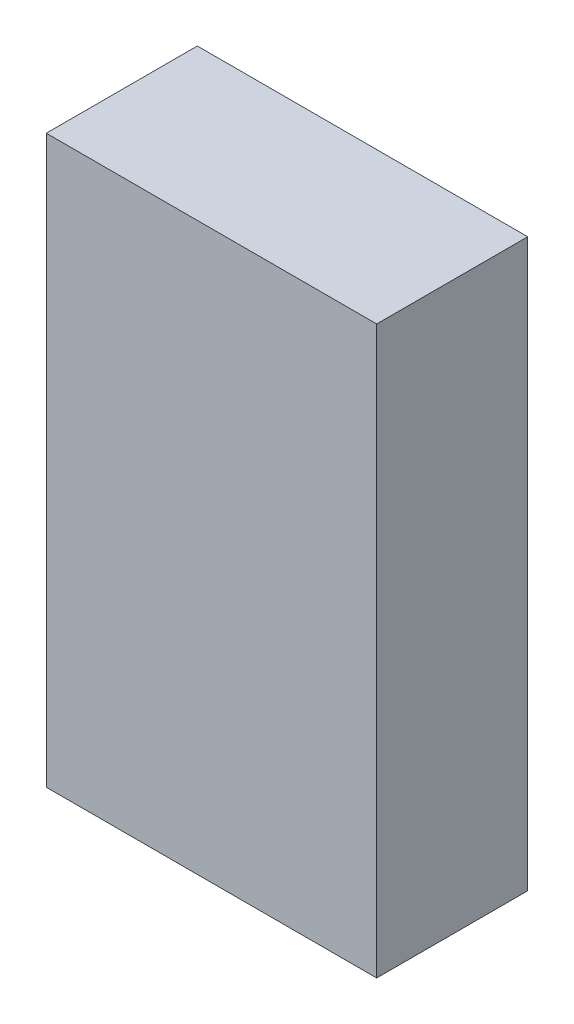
ISO-10303-21;
HEADER;
FILE_DESCRIPTION(('STEP AP214'),'2;1');
FILE_NAME('part.step','',(''),(''),'','','');
FILE_SCHEMA(('AUTOMOTIVE_DESIGN { 1 0 10303 214 1 1 1 1 }'));
ENDSEC;
DATA;
#1=APPLICATION_CONTEXT('core data for automotive mechanical design processes');
#2=APPLICATION_PROTOCOL_DEFINITION('international standard','automotive_design',2000,#1);
#3=PRODUCT_CONTEXT('',#1,'mechanical');
#4=PRODUCT('Part','Part','',(#3));
#5=PRODUCT_RELATED_PRODUCT_CATEGORY('part','',(#4));
#6=PRODUCT_DEFINITION_FORMATION('','',#4);
#7=PRODUCT_DEFINITION_CONTEXT('part definition',#1,'design');
#8=PRODUCT_DEFINITION('design','',#6,#7);
#9=PRODUCT_DEFINITION_SHAPE('','',#8);
#10=(LENGTH_UNIT() NAMED_UNIT(*) SI_UNIT(.MILLI.,.METRE.));
#11=(NAMED_UNIT(*) PLANE_ANGLE_UNIT() SI_UNIT($,.RADIAN.));
#12=(NAMED_UNIT(*) SI_UNIT($,.STERADIAN.) SOLID_ANGLE_UNIT());
#13=UNCERTAINTY_MEASURE_WITH_UNIT(LENGTH_MEASURE(1.E-05),#10,'distance_accuracy_value','');
#14=(GEOMETRIC_REPRESENTATION_CONTEXT(3) GLOBAL_UNCERTAINTY_ASSIGNED_CONTEXT((#13)) GLOBAL_UNIT_ASSIGNED_CONTEXT((#10,
#11,#12)) REPRESENTATION_CONTEXT('',''));
#15=CARTESIAN_POINT('',(0.,0.,0.));
#16=DIRECTION('',(0.,0.,1.));
#17=DIRECTION('',(1.,0.,0.));
#18=AXIS2_PLACEMENT_3D('',#15,#16,#17);
#19=CARTESIAN_POINT('',(0.87500206,1.49999954,0.8));
#20=DIRECTION('',(0.,0.,1.));
#21=DIRECTION('',(1.,0.,0.));
#22=AXIS2_PLACEMENT_3D('',#19,#20,#21);
#23=PLANE('',#22);
#24=DIRECTION('',(1.,0.,0.));
#25=VECTOR('',#24,1.);
#26=CARTESIAN_POINT('',(0.87500206,-1.49999954,0.8));
#27=LINE('',#26,#25);
#28=CARTESIAN_POINT('',(0.87500206,-1.49999954,0.8));
#29=VERTEX_POINT('',#28);
#30=CARTESIAN_POINT('',(-0.87499952,-1.49999954,0.8));
#31=VERTEX_POINT('',#30);
#32=EDGE_CURVE('E53',#29,#31,#27,.F.);
#33=ORIENTED_EDGE('',*,*,#32,.F.);
#34=DIRECTION('',(0.,1.,0.));
#35=VECTOR('',#34,1.);
#36=CARTESIAN_POINT('',(0.87500206,1.49999954,0.8));
#37=LINE('',#36,#35);
#38=CARTESIAN_POINT('',(0.87500206,1.49999954,0.8));
#39=VERTEX_POINT('',#38);
#40=EDGE_CURVE('E68',#39,#29,#37,.F.);
#41=ORIENTED_EDGE('',*,*,#40,.F.);
#42=DIRECTION('',(1.,0.,0.));
#43=VECTOR('',#42,1.);
#44=CARTESIAN_POINT('',(-0.87499952,1.49999954,0.8));
#45=LINE('',#44,#43);
#46=CARTESIAN_POINT('',(-0.87499952,1.49999954,0.8));
#47=VERTEX_POINT('',#46);
#48=EDGE_CURVE('E20',#47,#39,#45,.T.);
#49=ORIENTED_EDGE('',*,*,#48,.F.);
#50=DIRECTION('',(0.,1.,0.));
#51=VECTOR('',#50,1.);
#52=CARTESIAN_POINT('',(-0.87499952,-1.49999954,0.8));
#53=LINE('',#52,#51);
#54=EDGE_CURVE('E58',#31,#47,#53,.T.);
#55=ORIENTED_EDGE('',*,*,#54,.F.);
#56=EDGE_LOOP('',(#33,#41,#49,#55));
#57=FACE_BOUND('',#56,.T.);
#58=ADVANCED_FACE('F17',(#57),#23,.T.);
#59=CARTESIAN_POINT('',(-0.87499952,1.49999954,0.));
#60=DIRECTION('',(0.,1.,0.));
#61=DIRECTION('',(0.,0.,1.));
#62=AXIS2_PLACEMENT_3D('',#59,#60,#61);
#63=PLANE('',#62);
#64=DIRECTION('',(0.,0.,-1.));
#65=VECTOR('',#64,1.);
#66=CARTESIAN_POINT('',(0.87500206,1.49999954,0.));
#67=LINE('',#66,#65);
#68=CARTESIAN_POINT('',(0.87500206,1.49999954,0.));
#69=VERTEX_POINT('',#68);
#70=EDGE_CURVE('E79',#69,#39,#67,.F.);
#71=ORIENTED_EDGE('',*,*,#70,.F.);
#72=DIRECTION('',(1.,0.,0.));
#73=VECTOR('',#72,1.);
#74=CARTESIAN_POINT('',(0.87500206,1.49999954,0.));
#75=LINE('',#74,#73);
#76=CARTESIAN_POINT('',(-0.87499952,1.49999954,0.));
#77=VERTEX_POINT('',#76);
#78=EDGE_CURVE('E74',#69,#77,#75,.F.);
#79=ORIENTED_EDGE('',*,*,#78,.T.);
#80=DIRECTION('',(0.,0.,1.));
#81=VECTOR('',#80,1.);
#82=CARTESIAN_POINT('',(-0.87499952,1.49999954,0.));
#83=LINE('',#82,#81);
#84=EDGE_CURVE('E63',#47,#77,#83,.F.);
#85=ORIENTED_EDGE('',*,*,#84,.F.);
#86=ORIENTED_EDGE('',*,*,#48,.T.);
#87=EDGE_LOOP('',(#71,#79,#85,#86));
#88=FACE_BOUND('',#87,.T.);
#89=ADVANCED_FACE('F73',(#88),#63,.T.);
#90=CARTESIAN_POINT('',(-0.87499952,-1.49999954,0.));
#91=DIRECTION('',(-1.,0.,0.));
#92=DIRECTION('',(0.,0.,1.));
#93=AXIS2_PLACEMENT_3D('',#90,#91,#92);
#94=PLANE('',#93);
#95=ORIENTED_EDGE('',*,*,#84,.T.);
#96=DIRECTION('',(0.,1.,0.));
#97=VECTOR('',#96,1.);
#98=CARTESIAN_POINT('',(-0.87499952,1.49999954,0.));
#99=LINE('',#98,#97);
#100=CARTESIAN_POINT('',(-0.87499952,-1.49999954,0.));
#101=VERTEX_POINT('',#100);
#102=EDGE_CURVE('E84',#77,#101,#99,.F.);
#103=ORIENTED_EDGE('',*,*,#102,.T.);
#104=DIRECTION('',(0.,0.,-1.));
#105=VECTOR('',#104,1.);
#106=CARTESIAN_POINT('',(-0.87499952,-1.49999954,0.));
#107=LINE('',#106,#105);
#108=EDGE_CURVE('E65',#31,#101,#107,.T.);
#109=ORIENTED_EDGE('',*,*,#108,.F.);
#110=ORIENTED_EDGE('',*,*,#54,.T.);
#111=EDGE_LOOP('',(#95,#103,#109,#110));
#112=FACE_BOUND('',#111,.T.);
#113=ADVANCED_FACE('F60',(#112),#94,.T.);
#114=CARTESIAN_POINT('',(0.87500206,-1.49999954,0.));
#115=DIRECTION('',(0.,-1.,0.));
#116=DIRECTION('',(0.,0.,-1.));
#117=AXIS2_PLACEMENT_3D('',#114,#115,#116);
#118=PLANE('',#117);
#119=ORIENTED_EDGE('',*,*,#108,.T.);
#120=DIRECTION('',(1.,0.,0.));
#121=VECTOR('',#120,1.);
#122=CARTESIAN_POINT('',(0.87500206,-1.49999954,0.));
#123=LINE('',#122,#121);
#124=CARTESIAN_POINT('',(0.87500206,-1.49999954,0.));
#125=VERTEX_POINT('',#124);
#126=EDGE_CURVE('E26',#101,#125,#123,.T.);
#127=ORIENTED_EDGE('',*,*,#126,.T.);
#128=DIRECTION('',(0.,0.,-1.));
#129=VECTOR('',#128,1.);
#130=CARTESIAN_POINT('',(0.87500206,-1.49999954,0.));
#131=LINE('',#130,#129);
#132=EDGE_CURVE('E34',#29,#125,#131,.T.);
#133=ORIENTED_EDGE('',*,*,#132,.F.);
#134=ORIENTED_EDGE('',*,*,#32,.T.);
#135=EDGE_LOOP('',(#119,#127,#133,#134));
#136=FACE_BOUND('',#135,.T.);
#137=ADVANCED_FACE('F88',(#136),#118,.T.);
#138=CARTESIAN_POINT('',(0.87500206,1.49999954,0.));
#139=DIRECTION('',(1.,0.,0.));
#140=DIRECTION('',(0.,0.,-1.));
#141=AXIS2_PLACEMENT_3D('',#138,#139,#140);
#142=PLANE('',#141);
#143=ORIENTED_EDGE('',*,*,#132,.T.);
#144=DIRECTION('',(0.,1.,0.));
#145=VECTOR('',#144,1.);
#146=CARTESIAN_POINT('',(0.87500206,1.49999954,0.));
#147=LINE('',#146,#145);
#148=EDGE_CURVE('E11',#125,#69,#147,.T.);
#149=ORIENTED_EDGE('',*,*,#148,.T.);
#150=ORIENTED_EDGE('',*,*,#70,.T.);
#151=ORIENTED_EDGE('',*,*,#40,.T.);
#152=EDGE_LOOP('',(#143,#149,#150,#151));
#153=FACE_BOUND('',#152,.T.);
#154=ADVANCED_FACE('F91',(#153),#142,.T.);
#155=CARTESIAN_POINT('',(0.87500206,1.49999954,0.));
#156=DIRECTION('',(0.,0.,1.));
#157=DIRECTION('',(1.,0.,0.));
#158=AXIS2_PLACEMENT_3D('',#155,#156,#157);
#159=PLANE('',#158);
#160=ORIENTED_EDGE('',*,*,#126,.F.);
#161=ORIENTED_EDGE('',*,*,#102,.F.);
#162=ORIENTED_EDGE('',*,*,#78,.F.);
#163=ORIENTED_EDGE('',*,*,#148,.F.);
#164=EDGE_LOOP('',(#160,#161,#162,#163));
#165=FACE_BOUND('',#164,.T.);
#166=ADVANCED_FACE('F90',(#165),#159,.F.);
#167=CLOSED_SHELL('',(#58,#89,#113,#137,#154,#166));
#168=MANIFOLD_SOLID_BREP('B1',#167);
#169=ADVANCED_BREP_SHAPE_REPRESENTATION('',(#18,#168),#14);
#170=SHAPE_DEFINITION_REPRESENTATION(#9,#169);
ENDSEC;
END-ISO-10303-21;
